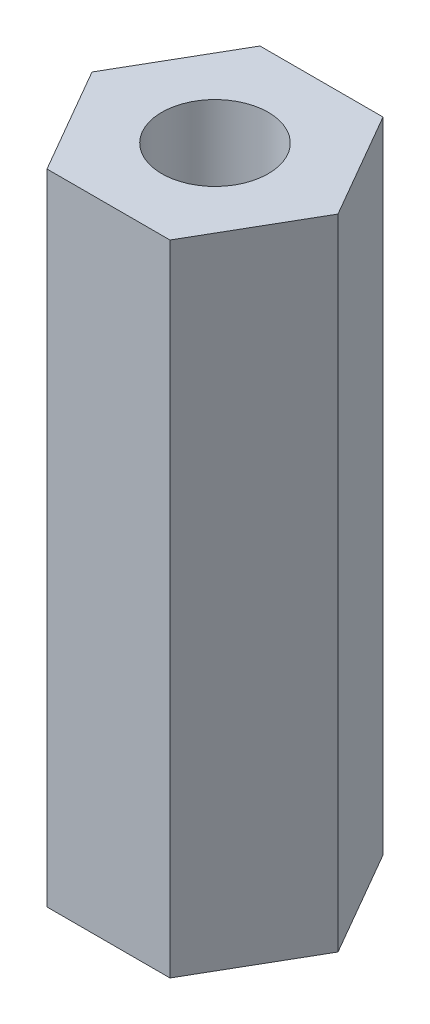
ISO-10303-21;
HEADER;
FILE_DESCRIPTION(('STEP AP214'),'2;1');
FILE_NAME('part.step','',(''),(''),'','','');
FILE_SCHEMA(('AUTOMOTIVE_DESIGN { 1 0 10303 214 1 1 1 1 }'));
ENDSEC;
DATA;
#1=APPLICATION_CONTEXT('core data for automotive mechanical design processes');
#2=APPLICATION_PROTOCOL_DEFINITION('international standard','automotive_design',2000,#1);
#3=PRODUCT_CONTEXT('',#1,'mechanical');
#4=PRODUCT('Part','Part','',(#3));
#5=PRODUCT_RELATED_PRODUCT_CATEGORY('part','',(#4));
#6=PRODUCT_DEFINITION_FORMATION('','',#4);
#7=PRODUCT_DEFINITION_CONTEXT('part definition',#1,'design');
#8=PRODUCT_DEFINITION('design','',#6,#7);
#9=PRODUCT_DEFINITION_SHAPE('','',#8);
#10=(LENGTH_UNIT() NAMED_UNIT(*) SI_UNIT(.MILLI.,.METRE.));
#11=(NAMED_UNIT(*) PLANE_ANGLE_UNIT() SI_UNIT($,.RADIAN.));
#12=(NAMED_UNIT(*) SI_UNIT($,.STERADIAN.) SOLID_ANGLE_UNIT());
#13=UNCERTAINTY_MEASURE_WITH_UNIT(LENGTH_MEASURE(1.E-05),#10,'distance_accuracy_value','');
#14=(GEOMETRIC_REPRESENTATION_CONTEXT(3) GLOBAL_UNCERTAINTY_ASSIGNED_CONTEXT((#13)) GLOBAL_UNIT_ASSIGNED_CONTEXT((#10,
#11,#12)) REPRESENTATION_CONTEXT('',''));
#15=CARTESIAN_POINT('',(0.,0.,0.));
#16=DIRECTION('',(0.,0.,1.));
#17=DIRECTION('',(1.,0.,0.));
#18=AXIS2_PLACEMENT_3D('',#15,#16,#17);
#19=CARTESIAN_POINT('',(0.,15.24,0.));
#20=DIRECTION('',(0.,1.,0.));
#21=DIRECTION('',(0.,0.,1.));
#22=AXIS2_PLACEMENT_3D('',#19,#20,#21);
#23=PLANE('',#22);
#24=DIRECTION('',(0.5,0.,-0.866025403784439));
#25=VECTOR('',#24,1.);
#26=CARTESIAN_POINT('',(1.46646968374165,15.24,2.54));
#27=LINE('',#26,#25);
#28=CARTESIAN_POINT('',(1.46646968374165,15.24,2.54));
#29=VERTEX_POINT('',#28);
#30=CARTESIAN_POINT('',(2.9329393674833,15.24,0.));
#31=VERTEX_POINT('',#30);
#32=EDGE_CURVE('E128',#29,#31,#27,.T.);
#33=ORIENTED_EDGE('',*,*,#32,.T.);
#34=DIRECTION('',(-0.499999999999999,0.,-0.866025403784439));
#35=VECTOR('',#34,1.);
#36=CARTESIAN_POINT('',(2.9329393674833,15.24,0.));
#37=LINE('',#36,#35);
#38=CARTESIAN_POINT('',(1.46646968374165,15.24,-2.54));
#39=VERTEX_POINT('',#38);
#40=EDGE_CURVE('E86',#31,#39,#37,.T.);
#41=ORIENTED_EDGE('',*,*,#40,.T.);
#42=DIRECTION('',(-1.,0.,0.));
#43=VECTOR('',#42,1.);
#44=CARTESIAN_POINT('',(1.46646968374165,15.24,-2.54));
#45=LINE('',#44,#43);
#46=CARTESIAN_POINT('',(-1.46646968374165,15.24,-2.54));
#47=VERTEX_POINT('',#46);
#48=EDGE_CURVE('E99',#39,#47,#45,.T.);
#49=ORIENTED_EDGE('',*,*,#48,.T.);
#50=DIRECTION('',(-0.5,0.,0.866025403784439));
#51=VECTOR('',#50,1.);
#52=CARTESIAN_POINT('',(-1.46646968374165,15.24,-2.54));
#53=LINE('',#52,#51);
#54=CARTESIAN_POINT('',(-2.9329393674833,15.24,0.));
#55=VERTEX_POINT('',#54);
#56=EDGE_CURVE('E93',#47,#55,#53,.T.);
#57=ORIENTED_EDGE('',*,*,#56,.T.);
#58=DIRECTION('',(0.500000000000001,0.,0.866025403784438));
#59=VECTOR('',#58,1.);
#60=CARTESIAN_POINT('',(-2.9329393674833,15.24,0.));
#61=LINE('',#60,#59);
#62=CARTESIAN_POINT('',(-1.46646968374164,15.24,2.54));
#63=VERTEX_POINT('',#62);
#64=EDGE_CURVE('E97',#55,#63,#61,.T.);
#65=ORIENTED_EDGE('',*,*,#64,.T.);
#66=DIRECTION('',(1.,0.,0.));
#67=VECTOR('',#66,1.);
#68=CARTESIAN_POINT('',(-1.46646968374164,15.24,2.54));
#69=LINE('',#68,#67);
#70=EDGE_CURVE('E49',#63,#29,#69,.T.);
#71=ORIENTED_EDGE('',*,*,#70,.T.);
#72=EDGE_LOOP('',(#33,#41,#49,#57,#65,#71));
#73=FACE_BOUND('',#72,.T.);
#74=CARTESIAN_POINT('',(0.,15.24,0.));
#75=DIRECTION('',(0.,1.,0.));
#76=DIRECTION('',(0.,0.,1.));
#77=AXIS2_PLACEMENT_3D('',#74,#75,#76);
#78=CIRCLE('',#77,1.27);
#79=CARTESIAN_POINT('',(0.,15.24,-1.27));
#80=VERTEX_POINT('',#79);
#81=EDGE_CURVE('E121',#80,#80,#78,.T.);
#82=ORIENTED_EDGE('',*,*,#81,.F.);
#83=EDGE_LOOP('',(#82));
#84=FACE_BOUND('',#83,.T.);
#85=ADVANCED_FACE('F32',(#73,#84),#23,.T.);
#86=CARTESIAN_POINT('',(0.,0.,0.));
#87=DIRECTION('',(0.,1.,0.));
#88=DIRECTION('',(0.,0.,1.));
#89=AXIS2_PLACEMENT_3D('',#86,#87,#88);
#90=PLANE('',#89);
#91=DIRECTION('',(0.5,0.,-0.866025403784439));
#92=VECTOR('',#91,1.);
#93=CARTESIAN_POINT('',(1.46646968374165,0.,2.54));
#94=LINE('',#93,#92);
#95=CARTESIAN_POINT('',(1.46646968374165,0.,2.54));
#96=VERTEX_POINT('',#95);
#97=CARTESIAN_POINT('',(2.9329393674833,0.,0.));
#98=VERTEX_POINT('',#97);
#99=EDGE_CURVE('E117',#96,#98,#94,.T.);
#100=ORIENTED_EDGE('',*,*,#99,.F.);
#101=DIRECTION('',(1.,0.,0.));
#102=VECTOR('',#101,1.);
#103=CARTESIAN_POINT('',(-1.46646968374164,0.,2.54));
#104=LINE('',#103,#102);
#105=CARTESIAN_POINT('',(-1.46646968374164,0.,2.54));
#106=VERTEX_POINT('',#105);
#107=EDGE_CURVE('E78',#106,#96,#104,.T.);
#108=ORIENTED_EDGE('',*,*,#107,.F.);
#109=DIRECTION('',(0.500000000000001,0.,0.866025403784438));
#110=VECTOR('',#109,1.);
#111=CARTESIAN_POINT('',(-2.9329393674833,0.,0.));
#112=LINE('',#111,#110);
#113=CARTESIAN_POINT('',(-2.9329393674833,0.,0.));
#114=VERTEX_POINT('',#113);
#115=EDGE_CURVE('E72',#114,#106,#112,.T.);
#116=ORIENTED_EDGE('',*,*,#115,.F.);
#117=DIRECTION('',(-0.5,0.,0.866025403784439));
#118=VECTOR('',#117,1.);
#119=CARTESIAN_POINT('',(-1.46646968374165,0.,-2.54));
#120=LINE('',#119,#118);
#121=CARTESIAN_POINT('',(-1.46646968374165,0.,-2.54));
#122=VERTEX_POINT('',#121);
#123=EDGE_CURVE('E107',#122,#114,#120,.T.);
#124=ORIENTED_EDGE('',*,*,#123,.F.);
#125=DIRECTION('',(-1.,0.,0.));
#126=VECTOR('',#125,1.);
#127=CARTESIAN_POINT('',(1.46646968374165,0.,-2.54));
#128=LINE('',#127,#126);
#129=CARTESIAN_POINT('',(1.46646968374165,0.,-2.54));
#130=VERTEX_POINT('',#129);
#131=EDGE_CURVE('E123',#130,#122,#128,.T.);
#132=ORIENTED_EDGE('',*,*,#131,.F.);
#133=DIRECTION('',(-0.499999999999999,0.,-0.866025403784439));
#134=VECTOR('',#133,1.);
#135=CARTESIAN_POINT('',(2.9329393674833,0.,0.));
#136=LINE('',#135,#134);
#137=EDGE_CURVE('E120',#98,#130,#136,.T.);
#138=ORIENTED_EDGE('',*,*,#137,.F.);
#139=EDGE_LOOP('',(#100,#108,#116,#124,#132,#138));
#140=FACE_BOUND('',#139,.T.);
#141=CARTESIAN_POINT('',(0.,0.,0.));
#142=DIRECTION('',(0.,1.,0.));
#143=DIRECTION('',(0.,0.,1.));
#144=AXIS2_PLACEMENT_3D('',#141,#142,#143);
#145=CIRCLE('',#144,1.27);
#146=CARTESIAN_POINT('',(0.,0.,-1.27));
#147=VERTEX_POINT('',#146);
#148=EDGE_CURVE('E221',#147,#147,#145,.T.);
#149=ORIENTED_EDGE('',*,*,#148,.T.);
#150=EDGE_LOOP('',(#149));
#151=FACE_BOUND('',#150,.T.);
#152=ADVANCED_FACE('F137',(#140,#151),#90,.F.);
#153=CARTESIAN_POINT('',(1.46646968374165,15.24,2.54));
#154=DIRECTION('',(-0.866025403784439,0.,-0.5));
#155=DIRECTION('',(-0.5,0.,0.866025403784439));
#156=AXIS2_PLACEMENT_3D('',#153,#154,#155);
#157=PLANE('',#156);
#158=ORIENTED_EDGE('',*,*,#99,.T.);
#159=DIRECTION('',(0.,-1.,0.));
#160=VECTOR('',#159,1.);
#161=CARTESIAN_POINT('',(2.9329393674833,15.24,0.));
#162=LINE('',#161,#160);
#163=EDGE_CURVE('E11',#31,#98,#162,.T.);
#164=ORIENTED_EDGE('',*,*,#163,.F.);
#165=ORIENTED_EDGE('',*,*,#32,.F.);
#166=DIRECTION('',(0.,-1.,0.));
#167=VECTOR('',#166,1.);
#168=CARTESIAN_POINT('',(1.46646968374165,15.24,2.54));
#169=LINE('',#168,#167);
#170=EDGE_CURVE('E113',#29,#96,#169,.T.);
#171=ORIENTED_EDGE('',*,*,#170,.T.);
#172=EDGE_LOOP('',(#158,#164,#165,#171));
#173=FACE_BOUND('',#172,.T.);
#174=ADVANCED_FACE('F34',(#173),#157,.F.);
#175=CARTESIAN_POINT('',(2.9329393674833,15.24,0.));
#176=DIRECTION('',(-0.866025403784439,0.,0.499999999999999));
#177=DIRECTION('',(0.499999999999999,0.,0.866025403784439));
#178=AXIS2_PLACEMENT_3D('',#175,#176,#177);
#179=PLANE('',#178);
#180=ORIENTED_EDGE('',*,*,#137,.T.);
#181=DIRECTION('',(0.,-1.,0.));
#182=VECTOR('',#181,1.);
#183=CARTESIAN_POINT('',(1.46646968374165,15.24,-2.54));
#184=LINE('',#183,#182);
#185=EDGE_CURVE('E41',#39,#130,#184,.T.);
#186=ORIENTED_EDGE('',*,*,#185,.F.);
#187=ORIENTED_EDGE('',*,*,#40,.F.);
#188=ORIENTED_EDGE('',*,*,#163,.T.);
#189=EDGE_LOOP('',(#180,#186,#187,#188));
#190=FACE_BOUND('',#189,.T.);
#191=ADVANCED_FACE('F162',(#190),#179,.F.);
#192=CARTESIAN_POINT('',(1.46646968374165,15.24,-2.54));
#193=DIRECTION('',(0.,0.,1.));
#194=DIRECTION('',(1.,0.,0.));
#195=AXIS2_PLACEMENT_3D('',#192,#193,#194);
#196=PLANE('',#195);
#197=ORIENTED_EDGE('',*,*,#131,.T.);
#198=DIRECTION('',(0.,-1.,0.));
#199=VECTOR('',#198,1.);
#200=CARTESIAN_POINT('',(-1.46646968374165,15.24,-2.54));
#201=LINE('',#200,#199);
#202=EDGE_CURVE('E108',#47,#122,#201,.T.);
#203=ORIENTED_EDGE('',*,*,#202,.F.);
#204=ORIENTED_EDGE('',*,*,#48,.F.);
#205=ORIENTED_EDGE('',*,*,#185,.T.);
#206=EDGE_LOOP('',(#197,#203,#204,#205));
#207=FACE_BOUND('',#206,.T.);
#208=ADVANCED_FACE('F134',(#207),#196,.F.);
#209=CARTESIAN_POINT('',(-1.46646968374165,15.24,-2.54));
#210=DIRECTION('',(0.866025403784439,0.,0.499999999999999));
#211=DIRECTION('',(0.5,0.,-0.866025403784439));
#212=AXIS2_PLACEMENT_3D('',#209,#210,#211);
#213=PLANE('',#212);
#214=ORIENTED_EDGE('',*,*,#123,.T.);
#215=DIRECTION('',(0.,-1.,0.));
#216=VECTOR('',#215,1.);
#217=CARTESIAN_POINT('',(-2.9329393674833,15.24,0.));
#218=LINE('',#217,#216);
#219=EDGE_CURVE('E104',#55,#114,#218,.T.);
#220=ORIENTED_EDGE('',*,*,#219,.F.);
#221=ORIENTED_EDGE('',*,*,#56,.F.);
#222=ORIENTED_EDGE('',*,*,#202,.T.);
#223=EDGE_LOOP('',(#214,#220,#221,#222));
#224=FACE_BOUND('',#223,.T.);
#225=ADVANCED_FACE('F105',(#224),#213,.F.);
#226=CARTESIAN_POINT('',(-2.9329393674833,15.24,0.));
#227=DIRECTION('',(0.866025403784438,0.,-0.500000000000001));
#228=DIRECTION('',(-0.500000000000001,0.,-0.866025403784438));
#229=AXIS2_PLACEMENT_3D('',#226,#227,#228);
#230=PLANE('',#229);
#231=ORIENTED_EDGE('',*,*,#115,.T.);
#232=DIRECTION('',(0.,-1.,0.));
#233=VECTOR('',#232,1.);
#234=CARTESIAN_POINT('',(-1.46646968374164,15.24,2.54));
#235=LINE('',#234,#233);
#236=EDGE_CURVE('E109',#63,#106,#235,.T.);
#237=ORIENTED_EDGE('',*,*,#236,.F.);
#238=ORIENTED_EDGE('',*,*,#64,.F.);
#239=ORIENTED_EDGE('',*,*,#219,.T.);
#240=EDGE_LOOP('',(#231,#237,#238,#239));
#241=FACE_BOUND('',#240,.T.);
#242=ADVANCED_FACE('F111',(#241),#230,.F.);
#243=CARTESIAN_POINT('',(-1.46646968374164,15.24,2.54));
#244=DIRECTION('',(0.,0.,-1.));
#245=DIRECTION('',(-1.,0.,0.));
#246=AXIS2_PLACEMENT_3D('',#243,#244,#245);
#247=PLANE('',#246);
#248=ORIENTED_EDGE('',*,*,#107,.T.);
#249=ORIENTED_EDGE('',*,*,#170,.F.);
#250=ORIENTED_EDGE('',*,*,#70,.F.);
#251=ORIENTED_EDGE('',*,*,#236,.T.);
#252=EDGE_LOOP('',(#248,#249,#250,#251));
#253=FACE_BOUND('',#252,.T.);
#254=ADVANCED_FACE('F142',(#253),#247,.F.);
#255=CARTESIAN_POINT('',(0.,15.24,0.));
#256=DIRECTION('',(0.,-1.,0.));
#257=DIRECTION('',(0.,0.,-1.));
#258=AXIS2_PLACEMENT_3D('',#255,#256,#257);
#259=CYLINDRICAL_SURFACE('',#258,1.27);
#260=CARTESIAN_POINT('',(0.,15.24,-1.27));
#261=CARTESIAN_POINT('',(0.,15.08125,-1.27));
#262=CARTESIAN_POINT('',(0.,14.9225,-1.27));
#263=CARTESIAN_POINT('',(0.,14.605,-1.27));
#264=CARTESIAN_POINT('',(0.,14.44625,-1.27));
#265=CARTESIAN_POINT('',(0.,14.12875,-1.27));
#266=CARTESIAN_POINT('',(0.,13.97,-1.27));
#267=CARTESIAN_POINT('',(0.,13.6525,-1.27));
#268=CARTESIAN_POINT('',(0.,13.49375,-1.27));
#269=CARTESIAN_POINT('',(0.,13.17625,-1.27));
#270=CARTESIAN_POINT('',(0.,13.0175,-1.27));
#271=CARTESIAN_POINT('',(0.,12.7,-1.27));
#272=CARTESIAN_POINT('',(0.,12.54125,-1.27));
#273=CARTESIAN_POINT('',(0.,12.22375,-1.27));
#274=CARTESIAN_POINT('',(0.,12.065,-1.27));
#275=CARTESIAN_POINT('',(0.,11.7475,-1.27));
#276=CARTESIAN_POINT('',(0.,11.58875,-1.27));
#277=CARTESIAN_POINT('',(0.,11.27125,-1.27));
#278=CARTESIAN_POINT('',(0.,11.1125,-1.27));
#279=CARTESIAN_POINT('',(0.,10.795,-1.27));
#280=CARTESIAN_POINT('',(0.,10.63625,-1.27));
#281=CARTESIAN_POINT('',(0.,10.31875,-1.27));
#282=CARTESIAN_POINT('',(0.,10.16,-1.27));
#283=CARTESIAN_POINT('',(0.,9.8425,-1.27));
#284=CARTESIAN_POINT('',(0.,9.68375,-1.27));
#285=CARTESIAN_POINT('',(0.,9.36625,-1.27));
#286=CARTESIAN_POINT('',(0.,9.2075,-1.27));
#287=CARTESIAN_POINT('',(0.,8.89,-1.27));
#288=CARTESIAN_POINT('',(0.,8.73125,-1.27));
#289=CARTESIAN_POINT('',(0.,8.41375,-1.27));
#290=CARTESIAN_POINT('',(0.,8.255,-1.27));
#291=CARTESIAN_POINT('',(0.,7.9375,-1.27));
#292=CARTESIAN_POINT('',(0.,7.77875,-1.27));
#293=CARTESIAN_POINT('',(0.,7.46125,-1.27));
#294=CARTESIAN_POINT('',(0.,7.3025,-1.27));
#295=CARTESIAN_POINT('',(0.,6.985,-1.27));
#296=CARTESIAN_POINT('',(0.,6.82625,-1.27));
#297=CARTESIAN_POINT('',(0.,6.50875,-1.27));
#298=CARTESIAN_POINT('',(0.,6.35,-1.27));
#299=CARTESIAN_POINT('',(0.,6.0325,-1.27));
#300=CARTESIAN_POINT('',(0.,5.87375,-1.27));
#301=CARTESIAN_POINT('',(0.,5.55625,-1.27));
#302=CARTESIAN_POINT('',(0.,5.3975,-1.27));
#303=CARTESIAN_POINT('',(0.,5.08,-1.27));
#304=CARTESIAN_POINT('',(0.,4.92125,-1.27));
#305=CARTESIAN_POINT('',(0.,4.60375,-1.27));
#306=CARTESIAN_POINT('',(0.,4.445,-1.27));
#307=CARTESIAN_POINT('',(0.,4.1275,-1.27));
#308=CARTESIAN_POINT('',(0.,3.96875,-1.27));
#309=CARTESIAN_POINT('',(0.,3.65125,-1.27));
#310=CARTESIAN_POINT('',(0.,3.4925,-1.27));
#311=CARTESIAN_POINT('',(0.,3.175,-1.27));
#312=CARTESIAN_POINT('',(0.,3.01625,-1.27));
#313=CARTESIAN_POINT('',(0.,2.69875,-1.27));
#314=CARTESIAN_POINT('',(0.,2.54,-1.27));
#315=CARTESIAN_POINT('',(0.,2.2225,-1.27));
#316=CARTESIAN_POINT('',(0.,2.06375,-1.27));
#317=CARTESIAN_POINT('',(0.,1.74625,-1.27));
#318=CARTESIAN_POINT('',(0.,1.5875,-1.27));
#319=CARTESIAN_POINT('',(0.,1.27,-1.27));
#320=CARTESIAN_POINT('',(0.,1.11125,-1.27));
#321=CARTESIAN_POINT('',(0.,0.79375,-1.27));
#322=CARTESIAN_POINT('',(0.,0.634999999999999,-1.27));
#323=CARTESIAN_POINT('',(0.,0.3175,-1.27));
#324=CARTESIAN_POINT('',(0.,0.15875,-1.27));
#325=CARTESIAN_POINT('',(0.,0.,-1.27));
#326=B_SPLINE_CURVE_WITH_KNOTS('',3,(#260,#261,#262,#263,#264,#265,#266,#267,#268,#269,#270,
#271,#272,#273,#274,#275,#276,#277,#278,#279,#280,#281,#282,#283,#284,#285,#286,#287,#288,#289,
#290,#291,#292,#293,#294,#295,#296,#297,#298,#299,#300,#301,#302,#303,#304,#305,#306,#307,#308,
#309,#310,#311,#312,#313,#314,#315,#316,#317,#318,#319,#320,#321,#322,#323,#324,#325),
.UNSPECIFIED.,.F.,.F.,(4,2,2,2,2,2,2,2,2,2,2,2,2,2,2,2,2,2,2,2,2,2,2,2,2,2,2,2,2,2,2,2,4),(0.,
0.476249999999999,0.952499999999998,1.42875,1.905,2.38125,2.8575,3.33375,3.81,4.28625,4.7625,
5.23875,5.715,6.19125,6.6675,7.14375,7.62,8.09625,8.5725,9.04875,9.525,10.00125,10.4775,
10.95375,11.43,11.90625,12.3825,12.85875,13.335,13.81125,14.2875,14.76375,15.24),.UNSPECIFIED.);
#327=EDGE_CURVE('BSEAM144',#80,#147,#326,.T.);
#328=ORIENTED_EDGE('',*,*,#81,.T.);
#329=ORIENTED_EDGE('',*,*,#148,.F.);
#330=ORIENTED_EDGE('',*,*,#327,.T.);
#331=ORIENTED_EDGE('',*,*,#327,.F.);
#332=EDGE_LOOP('',(#328,#330,#329,#331));
#333=FACE_BOUND('',#332,.T.);
#334=ADVANCED_FACE('F144',(#333),#259,.F.);
#335=CLOSED_SHELL('',(#85,#152,#174,#191,#208,#225,#242,#254,#334));
#336=MANIFOLD_SOLID_BREP('B2',#335);
#337=ADVANCED_BREP_SHAPE_REPRESENTATION('',(#18,#336),#14);
#338=SHAPE_DEFINITION_REPRESENTATION(#9,#337);
ENDSEC;
END-ISO-10303-21;
